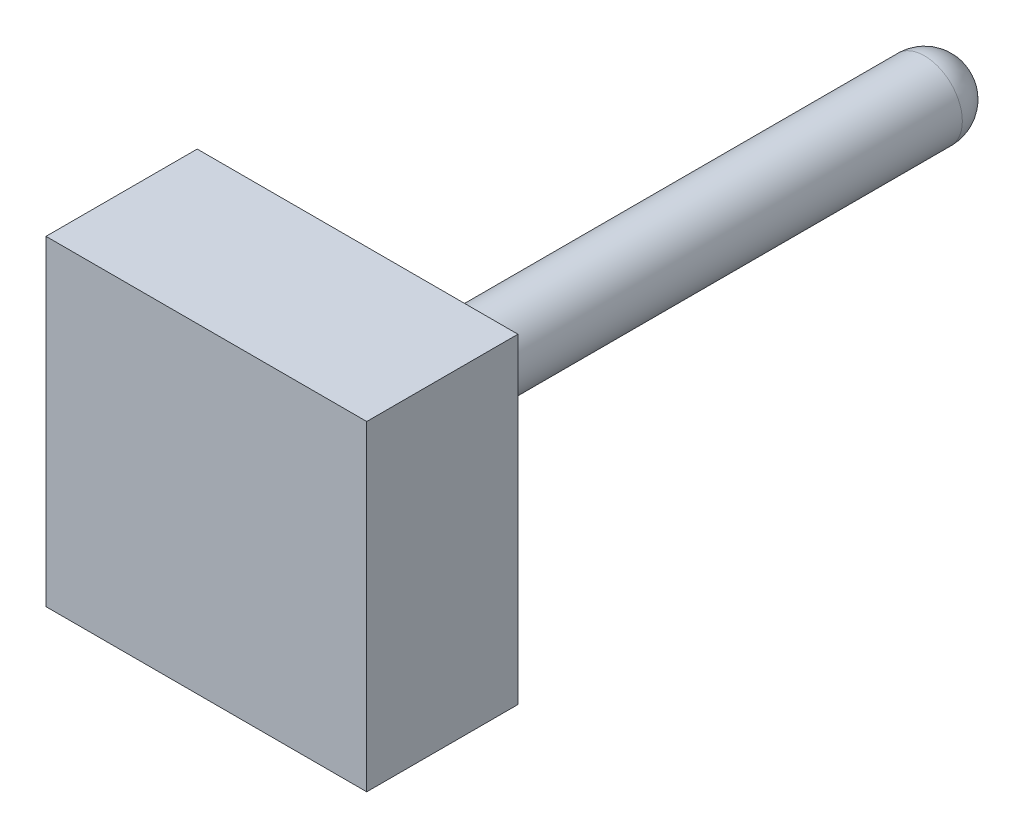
from build123d import *

# Parameters (mm, degrees)
SKETCH1_R      = 0.396875
EXTRUDE1_DEPTH = 6.35
SKETCH2_W      = 3.367596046
SKETCH2_H      = 3.367596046
EXTRUDE3_DEPTH = 1.5875
FILLET2_R      = 0.396875


with BuildPart() as part:
    # Sketch1 → Extrude1 (new body)
    with BuildSketch(Plane.XY):
        Circle(SKETCH1_R)
    extrude(amount=EXTRUDE1_DEPTH)

    # Sketch2 → Extrude3 (add)
    with BuildSketch(Plane.XY.offset(6.35)):
        Rectangle(SKETCH2_W, SKETCH2_H)
    extrude(amount=EXTRUDE3_DEPTH)

    # Fillet2
    fillet2_edges = [part.edges().sort_by_distance(p)[0] for p in [
        (-0.396875, 0, 0),
    ]]
    fillet(fillet2_edges, radius=FILLET2_R)


solid = part.part
